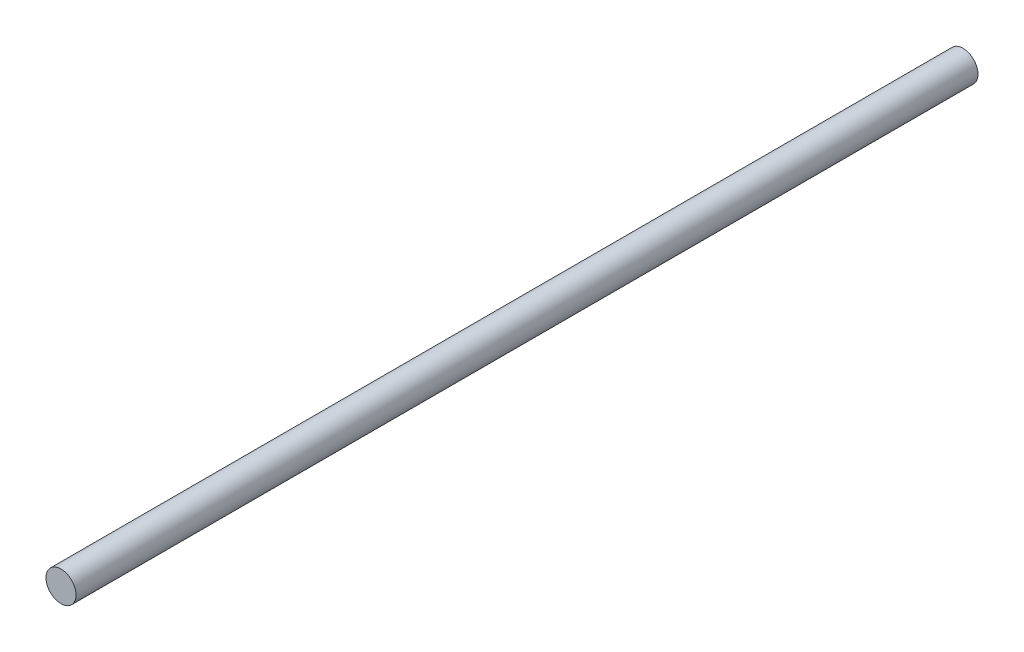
ISO-10303-21;
HEADER;
FILE_DESCRIPTION(('STEP AP214'),'2;1');
FILE_NAME('part.step','',(''),(''),'','','');
FILE_SCHEMA(('AUTOMOTIVE_DESIGN { 1 0 10303 214 1 1 1 1 }'));
ENDSEC;
DATA;
#1=APPLICATION_CONTEXT('core data for automotive mechanical design processes');
#2=APPLICATION_PROTOCOL_DEFINITION('international standard','automotive_design',2000,#1);
#3=PRODUCT_CONTEXT('',#1,'mechanical');
#4=PRODUCT('Part','Part','',(#3));
#5=PRODUCT_RELATED_PRODUCT_CATEGORY('part','',(#4));
#6=PRODUCT_DEFINITION_FORMATION('','',#4);
#7=PRODUCT_DEFINITION_CONTEXT('part definition',#1,'design');
#8=PRODUCT_DEFINITION('design','',#6,#7);
#9=PRODUCT_DEFINITION_SHAPE('','',#8);
#10=(LENGTH_UNIT() NAMED_UNIT(*) SI_UNIT(.MILLI.,.METRE.));
#11=(NAMED_UNIT(*) PLANE_ANGLE_UNIT() SI_UNIT($,.RADIAN.));
#12=(NAMED_UNIT(*) SI_UNIT($,.STERADIAN.) SOLID_ANGLE_UNIT());
#13=UNCERTAINTY_MEASURE_WITH_UNIT(LENGTH_MEASURE(1.E-05),#10,'distance_accuracy_value','');
#14=(GEOMETRIC_REPRESENTATION_CONTEXT(3) GLOBAL_UNCERTAINTY_ASSIGNED_CONTEXT((#13)) GLOBAL_UNIT_ASSIGNED_CONTEXT((#10,
#11,#12)) REPRESENTATION_CONTEXT('',''));
#15=CARTESIAN_POINT('',(0.,0.,0.));
#16=DIRECTION('',(0.,0.,1.));
#17=DIRECTION('',(1.,0.,0.));
#18=AXIS2_PLACEMENT_3D('',#15,#16,#17);
#19=CARTESIAN_POINT('',(0.,0.,-1800.));
#20=DIRECTION('',(0.,0.,1.));
#21=DIRECTION('',(1.,0.,0.));
#22=AXIS2_PLACEMENT_3D('',#19,#20,#21);
#23=CYLINDRICAL_SURFACE('',#22,30.);
#24=CARTESIAN_POINT('',(0.,0.,-1800.));
#25=DIRECTION('',(0.,0.,1.));
#26=DIRECTION('',(1.,0.,0.));
#27=AXIS2_PLACEMENT_3D('',#24,#25,#26);
#28=CIRCLE('',#27,30.);
#29=CARTESIAN_POINT('',(30.,0.,-1800.));
#30=VERTEX_POINT('',#29);
#31=EDGE_CURVE('E10',#30,#30,#28,.T.);
#32=ORIENTED_EDGE('',*,*,#31,.T.);
#33=EDGE_LOOP('',(#32));
#34=FACE_BOUND('',#33,.T.);
#35=CARTESIAN_POINT('',(0.,0.,0.));
#36=DIRECTION('',(0.,0.,1.));
#37=DIRECTION('',(1.,0.,0.));
#38=AXIS2_PLACEMENT_3D('',#35,#36,#37);
#39=CIRCLE('',#38,30.);
#40=CARTESIAN_POINT('',(30.,0.,0.));
#41=VERTEX_POINT('',#40);
#42=EDGE_CURVE('E40',#41,#41,#39,.T.);
#43=ORIENTED_EDGE('',*,*,#42,.F.);
#44=EDGE_LOOP('',(#43));
#45=FACE_BOUND('',#44,.T.);
#46=ADVANCED_FACE('F37',(#34,#45),#23,.T.);
#47=CARTESIAN_POINT('',(0.,0.,-1800.));
#48=DIRECTION('',(0.,0.,1.));
#49=DIRECTION('',(1.,0.,0.));
#50=AXIS2_PLACEMENT_3D('',#47,#48,#49);
#51=PLANE('',#50);
#52=ORIENTED_EDGE('',*,*,#31,.F.);
#53=EDGE_LOOP('',(#52));
#54=FACE_BOUND('',#53,.T.);
#55=ADVANCED_FACE('F54',(#54),#51,.F.);
#56=CARTESIAN_POINT('',(0.,0.,0.));
#57=DIRECTION('',(0.,0.,1.));
#58=DIRECTION('',(1.,0.,0.));
#59=AXIS2_PLACEMENT_3D('',#56,#57,#58);
#60=PLANE('',#59);
#61=ORIENTED_EDGE('',*,*,#42,.T.);
#62=EDGE_LOOP('',(#61));
#63=FACE_BOUND('',#62,.T.);
#64=ADVANCED_FACE('F51',(#63),#60,.T.);
#65=CLOSED_SHELL('',(#46,#55,#64));
#66=MANIFOLD_SOLID_BREP('B2',#65);
#67=ADVANCED_BREP_SHAPE_REPRESENTATION('',(#18,#66),#14);
#68=SHAPE_DEFINITION_REPRESENTATION(#9,#67);
ENDSEC;
END-ISO-10303-21;
